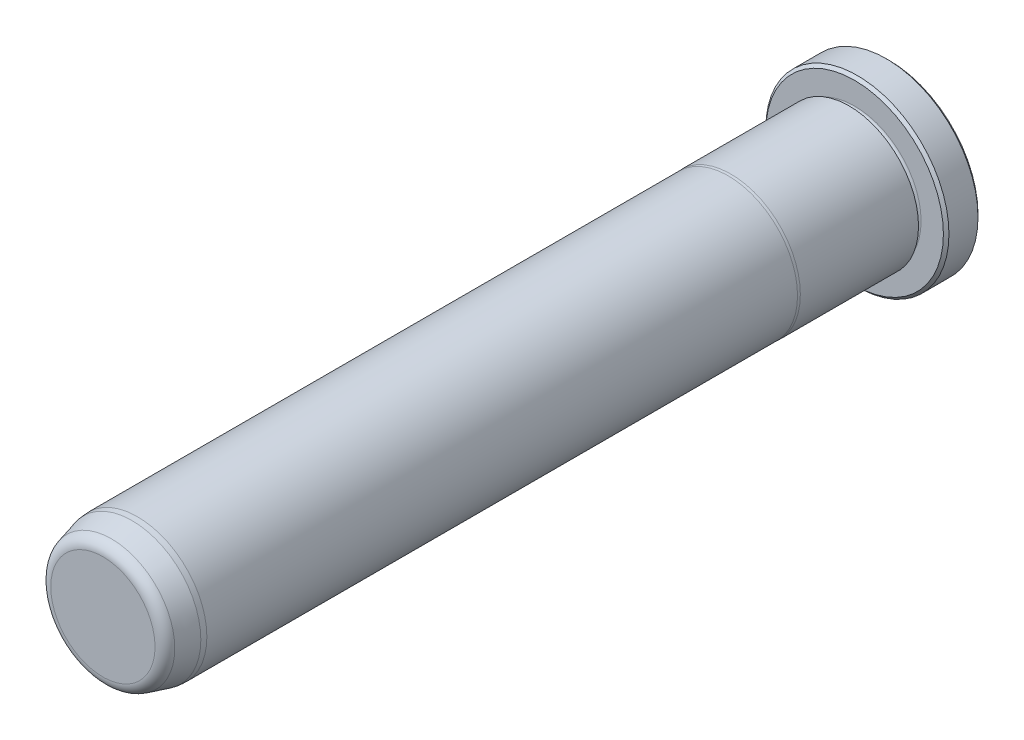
from build123d import *

# Parameters (mm, degrees)
FILLET6_R     = 1.5875
CHAMFER1_SIZE = 0.381


with BuildPart() as part:
    # Sketch1 → Revolve1 (revolve)
    with BuildSketch(Plane(origin=(0, 0, 0), x_dir=(0, 0, -1), z_dir=(1, 0, 0)), mode=Mode.PRIVATE) as revolve1_sk:
        with BuildLine():
            Line((0, 0), (0, 12.573))
            Line((0, 12.573), (-4.7498, 12.573))
            Line((-4.7498, 12.573), (-4.7498, 9.1313))
            ThreePointArc((-4.7498, 9.1313), (-5.1308, 8.7503), (-5.5118, 9.1313))
            Line((-5.5118, 9.1313), (-5.5118, 9.5377))
            Line((-5.5118, 9.5377), (-21.734763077, 9.5377))
            Line((-21.734763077, 9.5377), (-22.098, 9.5123))
            Line((-22.098, 9.5123), (-103.1875, 9.5123))
            Line((-103.1875, 9.5123), (-103.9495, 9.445633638))
            Line((-103.9495, 9.445633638), (-107.95, 8.373702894))
            Line((-107.95, 8.373702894), (-107.95, 0))
            Line((-107.95, 0), (0, 0))
        make_face()
    revolve(revolve1_sk.sketch.rotate(Axis((0, 0, 0), (0, 0, -1)), 90), axis=Axis((0, 0, 0), (0, 0, -1)))

    # Fillet6
    fillet6_edges = [part.edges().sort_by_distance(p)[0] for p in [
        (-8.373702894, 0, 107.95),
    ]]
    fillet(fillet6_edges, radius=FILLET6_R)

    # Chamfer1
    chamfer1_edges = [part.edges().sort_by_distance(p)[0] for p in [
        (-12.573, 0, 4.7498),
        (-12.573, 0, 0),
    ]]
    chamfer(chamfer1_edges, length=CHAMFER1_SIZE)


solid = part.part
